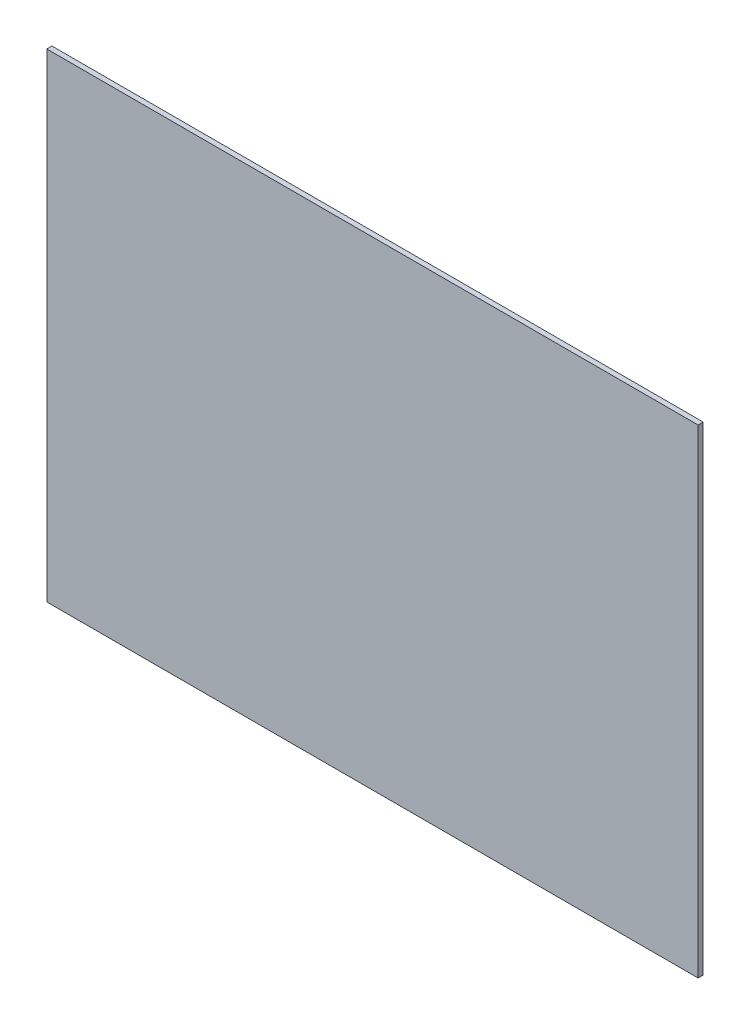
ISO-10303-21;
HEADER;
FILE_DESCRIPTION(('STEP AP214'),'2;1');
FILE_NAME('part.step','',(''),(''),'','','');
FILE_SCHEMA(('AUTOMOTIVE_DESIGN { 1 0 10303 214 1 1 1 1 }'));
ENDSEC;
DATA;
#1=APPLICATION_CONTEXT('core data for automotive mechanical design processes');
#2=APPLICATION_PROTOCOL_DEFINITION('international standard','automotive_design',2000,#1);
#3=PRODUCT_CONTEXT('',#1,'mechanical');
#4=PRODUCT('Part','Part','',(#3));
#5=PRODUCT_RELATED_PRODUCT_CATEGORY('part','',(#4));
#6=PRODUCT_DEFINITION_FORMATION('','',#4);
#7=PRODUCT_DEFINITION_CONTEXT('part definition',#1,'design');
#8=PRODUCT_DEFINITION('design','',#6,#7);
#9=PRODUCT_DEFINITION_SHAPE('','',#8);
#10=(LENGTH_UNIT() NAMED_UNIT(*) SI_UNIT(.MILLI.,.METRE.));
#11=(NAMED_UNIT(*) PLANE_ANGLE_UNIT() SI_UNIT($,.RADIAN.));
#12=(NAMED_UNIT(*) SI_UNIT($,.STERADIAN.) SOLID_ANGLE_UNIT());
#13=UNCERTAINTY_MEASURE_WITH_UNIT(LENGTH_MEASURE(1.E-05),#10,'distance_accuracy_value','');
#14=(GEOMETRIC_REPRESENTATION_CONTEXT(3) GLOBAL_UNCERTAINTY_ASSIGNED_CONTEXT((#13)) GLOBAL_UNIT_ASSIGNED_CONTEXT((#10,
#11,#12)) REPRESENTATION_CONTEXT('',''));
#15=CARTESIAN_POINT('',(0.,0.,0.));
#16=DIRECTION('',(0.,0.,1.));
#17=DIRECTION('',(1.,0.,0.));
#18=AXIS2_PLACEMENT_3D('',#15,#16,#17);
#19=CARTESIAN_POINT('',(255.,-187.5,4.));
#20=DIRECTION('',(-1.,0.,0.));
#21=DIRECTION('',(0.,0.,1.));
#22=AXIS2_PLACEMENT_3D('',#19,#20,#21);
#23=PLANE('',#22);
#24=DIRECTION('',(0.,1.,0.));
#25=VECTOR('',#24,1.);
#26=CARTESIAN_POINT('',(255.,-187.5,0.));
#27=LINE('',#26,#25);
#28=CARTESIAN_POINT('',(255.,-187.5,0.));
#29=VERTEX_POINT('',#28);
#30=CARTESIAN_POINT('',(255.,187.5,0.));
#31=VERTEX_POINT('',#30);
#32=EDGE_CURVE('E107',#29,#31,#27,.T.);
#33=ORIENTED_EDGE('',*,*,#32,.T.);
#34=DIRECTION('',(0.,0.,-1.));
#35=VECTOR('',#34,1.);
#36=CARTESIAN_POINT('',(255.,187.5,4.));
#37=LINE('',#36,#35);
#38=CARTESIAN_POINT('',(255.,187.5,4.));
#39=VERTEX_POINT('',#38);
#40=EDGE_CURVE('E11',#39,#31,#37,.T.);
#41=ORIENTED_EDGE('',*,*,#40,.F.);
#42=DIRECTION('',(0.,1.,0.));
#43=VECTOR('',#42,1.);
#44=CARTESIAN_POINT('',(255.,-187.5,4.));
#45=LINE('',#44,#43);
#46=CARTESIAN_POINT('',(255.,-187.5,4.));
#47=VERTEX_POINT('',#46);
#48=EDGE_CURVE('E90',#47,#39,#45,.T.);
#49=ORIENTED_EDGE('',*,*,#48,.F.);
#50=DIRECTION('',(0.,0.,-1.));
#51=VECTOR('',#50,1.);
#52=CARTESIAN_POINT('',(255.,-187.5,4.));
#53=LINE('',#52,#51);
#54=EDGE_CURVE('E103',#47,#29,#53,.T.);
#55=ORIENTED_EDGE('',*,*,#54,.T.);
#56=EDGE_LOOP('',(#33,#41,#49,#55));
#57=FACE_BOUND('',#56,.T.);
#58=ADVANCED_FACE('F38',(#57),#23,.F.);
#59=CARTESIAN_POINT('',(-255.,187.5,4.));
#60=DIRECTION('',(0.,-1.,0.));
#61=DIRECTION('',(0.,0.,-1.));
#62=AXIS2_PLACEMENT_3D('',#59,#60,#61);
#63=PLANE('',#62);
#64=DIRECTION('',(-1.,0.,0.));
#65=VECTOR('',#64,1.);
#66=CARTESIAN_POINT('',(-255.,187.5,0.));
#67=LINE('',#66,#65);
#68=CARTESIAN_POINT('',(-255.,187.5,0.));
#69=VERTEX_POINT('',#68);
#70=EDGE_CURVE('E95',#31,#69,#67,.T.);
#71=ORIENTED_EDGE('',*,*,#70,.T.);
#72=DIRECTION('',(0.,0.,-1.));
#73=VECTOR('',#72,1.);
#74=CARTESIAN_POINT('',(-255.,187.5,4.));
#75=LINE('',#74,#73);
#76=CARTESIAN_POINT('',(-255.,187.5,4.));
#77=VERTEX_POINT('',#76);
#78=EDGE_CURVE('E47',#77,#69,#75,.T.);
#79=ORIENTED_EDGE('',*,*,#78,.F.);
#80=DIRECTION('',(-1.,0.,0.));
#81=VECTOR('',#80,1.);
#82=CARTESIAN_POINT('',(-255.,187.5,4.));
#83=LINE('',#82,#81);
#84=EDGE_CURVE('E85',#39,#77,#83,.T.);
#85=ORIENTED_EDGE('',*,*,#84,.F.);
#86=ORIENTED_EDGE('',*,*,#40,.T.);
#87=EDGE_LOOP('',(#71,#79,#85,#86));
#88=FACE_BOUND('',#87,.T.);
#89=ADVANCED_FACE('F94',(#88),#63,.F.);
#90=CARTESIAN_POINT('',(-255.,-187.5,4.));
#91=DIRECTION('',(1.,0.,0.));
#92=DIRECTION('',(0.,0.,-1.));
#93=AXIS2_PLACEMENT_3D('',#90,#91,#92);
#94=PLANE('',#93);
#95=DIRECTION('',(0.,-1.,0.));
#96=VECTOR('',#95,1.);
#97=CARTESIAN_POINT('',(-255.,-187.5,0.));
#98=LINE('',#97,#96);
#99=CARTESIAN_POINT('',(-255.,-187.5,0.));
#100=VERTEX_POINT('',#99);
#101=EDGE_CURVE('E72',#69,#100,#98,.T.);
#102=ORIENTED_EDGE('',*,*,#101,.T.);
#103=DIRECTION('',(0.,0.,-1.));
#104=VECTOR('',#103,1.);
#105=CARTESIAN_POINT('',(-255.,-187.5,4.));
#106=LINE('',#105,#104);
#107=CARTESIAN_POINT('',(-255.,-187.5,4.));
#108=VERTEX_POINT('',#107);
#109=EDGE_CURVE('E97',#108,#100,#106,.T.);
#110=ORIENTED_EDGE('',*,*,#109,.F.);
#111=DIRECTION('',(0.,-1.,0.));
#112=VECTOR('',#111,1.);
#113=CARTESIAN_POINT('',(-255.,-187.5,4.));
#114=LINE('',#113,#112);
#115=EDGE_CURVE('E88',#77,#108,#114,.T.);
#116=ORIENTED_EDGE('',*,*,#115,.F.);
#117=ORIENTED_EDGE('',*,*,#78,.T.);
#118=EDGE_LOOP('',(#102,#110,#116,#117));
#119=FACE_BOUND('',#118,.T.);
#120=ADVANCED_FACE('F98',(#119),#94,.F.);
#121=CARTESIAN_POINT('',(-255.,-187.5,4.));
#122=DIRECTION('',(0.,1.,0.));
#123=DIRECTION('',(0.,0.,1.));
#124=AXIS2_PLACEMENT_3D('',#121,#122,#123);
#125=PLANE('',#124);
#126=DIRECTION('',(1.,0.,0.));
#127=VECTOR('',#126,1.);
#128=CARTESIAN_POINT('',(-255.,-187.5,0.));
#129=LINE('',#128,#127);
#130=EDGE_CURVE('E78',#100,#29,#129,.T.);
#131=ORIENTED_EDGE('',*,*,#130,.T.);
#132=ORIENTED_EDGE('',*,*,#54,.F.);
#133=DIRECTION('',(1.,0.,0.));
#134=VECTOR('',#133,1.);
#135=CARTESIAN_POINT('',(-255.,-187.5,4.));
#136=LINE('',#135,#134);
#137=EDGE_CURVE('E55',#108,#47,#136,.T.);
#138=ORIENTED_EDGE('',*,*,#137,.F.);
#139=ORIENTED_EDGE('',*,*,#109,.T.);
#140=EDGE_LOOP('',(#131,#132,#138,#139));
#141=FACE_BOUND('',#140,.T.);
#142=ADVANCED_FACE('F121',(#141),#125,.F.);
#143=CARTESIAN_POINT('',(0.,0.,4.));
#144=DIRECTION('',(0.,0.,-1.));
#145=DIRECTION('',(-1.,0.,0.));
#146=AXIS2_PLACEMENT_3D('',#143,#144,#145);
#147=PLANE('',#146);
#148=ORIENTED_EDGE('',*,*,#48,.T.);
#149=ORIENTED_EDGE('',*,*,#84,.T.);
#150=ORIENTED_EDGE('',*,*,#115,.T.);
#151=ORIENTED_EDGE('',*,*,#137,.T.);
#152=EDGE_LOOP('',(#148,#149,#150,#151));
#153=FACE_BOUND('',#152,.T.);
#154=ADVANCED_FACE('F86',(#153),#147,.F.);
#155=CARTESIAN_POINT('',(0.,0.,0.));
#156=DIRECTION('',(0.,0.,-1.));
#157=DIRECTION('',(-1.,0.,0.));
#158=AXIS2_PLACEMENT_3D('',#155,#156,#157);
#159=PLANE('',#158);
#160=ORIENTED_EDGE('',*,*,#32,.F.);
#161=ORIENTED_EDGE('',*,*,#130,.F.);
#162=ORIENTED_EDGE('',*,*,#101,.F.);
#163=ORIENTED_EDGE('',*,*,#70,.F.);
#164=EDGE_LOOP('',(#160,#161,#162,#163));
#165=FACE_BOUND('',#164,.T.);
#166=ADVANCED_FACE('F124',(#165),#159,.T.);
#167=CLOSED_SHELL('',(#58,#89,#120,#142,#154,#166));
#168=MANIFOLD_SOLID_BREP('B2',#167);
#169=ADVANCED_BREP_SHAPE_REPRESENTATION('',(#18,#168),#14);
#170=SHAPE_DEFINITION_REPRESENTATION(#9,#169);
ENDSEC;
END-ISO-10303-21;
